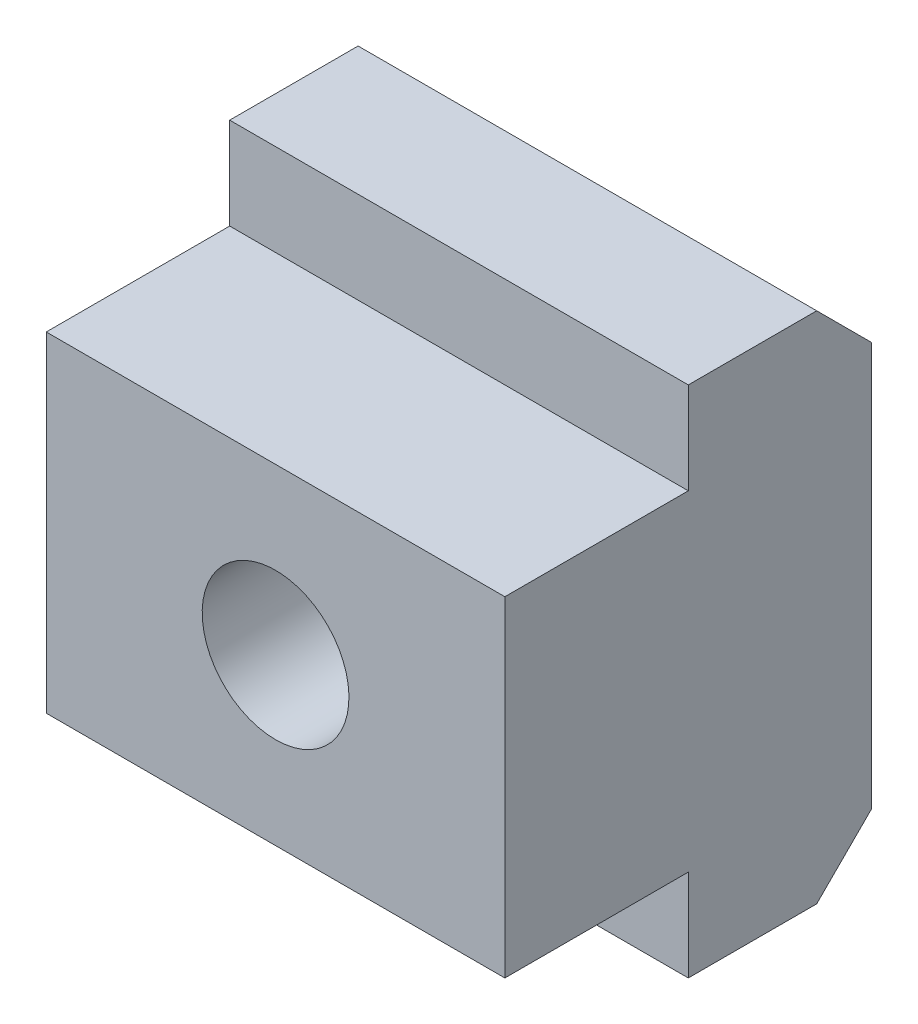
ISO-10303-21;
HEADER;
FILE_DESCRIPTION(('STEP AP214'),'2;1');
FILE_NAME('part.step','',(''),(''),'','','');
FILE_SCHEMA(('AUTOMOTIVE_DESIGN { 1 0 10303 214 1 1 1 1 }'));
ENDSEC;
DATA;
#1=APPLICATION_CONTEXT('core data for automotive mechanical design processes');
#2=APPLICATION_PROTOCOL_DEFINITION('international standard','automotive_design',2000,#1);
#3=PRODUCT_CONTEXT('',#1,'mechanical');
#4=PRODUCT('Part','Part','',(#3));
#5=PRODUCT_RELATED_PRODUCT_CATEGORY('part','',(#4));
#6=PRODUCT_DEFINITION_FORMATION('','',#4);
#7=PRODUCT_DEFINITION_CONTEXT('part definition',#1,'design');
#8=PRODUCT_DEFINITION('design','',#6,#7);
#9=PRODUCT_DEFINITION_SHAPE('','',#8);
#10=(LENGTH_UNIT() NAMED_UNIT(*) SI_UNIT(.MILLI.,.METRE.));
#11=(NAMED_UNIT(*) PLANE_ANGLE_UNIT() SI_UNIT($,.RADIAN.));
#12=(NAMED_UNIT(*) SI_UNIT($,.STERADIAN.) SOLID_ANGLE_UNIT());
#13=UNCERTAINTY_MEASURE_WITH_UNIT(LENGTH_MEASURE(1.E-05),#10,'distance_accuracy_value','');
#14=(GEOMETRIC_REPRESENTATION_CONTEXT(3) GLOBAL_UNCERTAINTY_ASSIGNED_CONTEXT((#13)) GLOBAL_UNIT_ASSIGNED_CONTEXT((#10,
#11,#12)) REPRESENTATION_CONTEXT('',''));
#15=CARTESIAN_POINT('',(0.,0.,0.));
#16=DIRECTION('',(0.,0.,1.));
#17=DIRECTION('',(1.,0.,0.));
#18=AXIS2_PLACEMENT_3D('',#15,#16,#17);
#19=CARTESIAN_POINT('',(12.5,9.,10.));
#20=DIRECTION('',(0.,-1.,0.));
#21=DIRECTION('',(0.,0.,-1.));
#22=AXIS2_PLACEMENT_3D('',#19,#20,#21);
#23=PLANE('',#22);
#24=DIRECTION('',(0.,0.,1.));
#25=VECTOR('',#24,1.);
#26=CARTESIAN_POINT('',(-12.5,9.,10.));
#27=LINE('',#26,#25);
#28=CARTESIAN_POINT('',(-12.5,9.,0.));
#29=VERTEX_POINT('',#28);
#30=CARTESIAN_POINT('',(-12.5,9.,10.));
#31=VERTEX_POINT('',#30);
#32=EDGE_CURVE('E98',#29,#31,#27,.T.);
#33=ORIENTED_EDGE('',*,*,#32,.T.);
#34=DIRECTION('',(-1.,0.,0.));
#35=VECTOR('',#34,1.);
#36=CARTESIAN_POINT('',(12.5,9.,10.));
#37=LINE('',#36,#35);
#38=CARTESIAN_POINT('',(12.5,9.,10.));
#39=VERTEX_POINT('',#38);
#40=EDGE_CURVE('E106',#39,#31,#37,.T.);
#41=ORIENTED_EDGE('',*,*,#40,.F.);
#42=DIRECTION('',(0.,0.,1.));
#43=VECTOR('',#42,1.);
#44=CARTESIAN_POINT('',(12.5,9.,10.));
#45=LINE('',#44,#43);
#46=CARTESIAN_POINT('',(12.5,9.,0.));
#47=VERTEX_POINT('',#46);
#48=EDGE_CURVE('E136',#47,#39,#45,.T.);
#49=ORIENTED_EDGE('',*,*,#48,.F.);
#50=DIRECTION('',(-1.,0.,0.));
#51=VECTOR('',#50,1.);
#52=CARTESIAN_POINT('',(12.5,9.,0.));
#53=LINE('',#52,#51);
#54=EDGE_CURVE('E117',#47,#29,#53,.T.);
#55=ORIENTED_EDGE('',*,*,#54,.T.);
#56=EDGE_LOOP('',(#33,#41,#49,#55));
#57=FACE_BOUND('',#56,.T.);
#58=ADVANCED_FACE('F14',(#57),#23,.F.);
#59=CARTESIAN_POINT('',(12.5,-9.,10.));
#60=DIRECTION('',(0.,0.,-1.));
#61=DIRECTION('',(0.,1.,0.));
#62=AXIS2_PLACEMENT_3D('',#59,#60,#61);
#63=PLANE('',#62);
#64=CARTESIAN_POINT('',(0.,0.,10.));
#65=DIRECTION('',(0.,0.,1.));
#66=DIRECTION('',(0.,-1.,0.));
#67=AXIS2_PLACEMENT_3D('',#64,#65,#66);
#68=CIRCLE('',#67,4.);
#69=CARTESIAN_POINT('',(0.,-4.,10.));
#70=VERTEX_POINT('',#69);
#71=EDGE_CURVE('E121',#70,#70,#68,.T.);
#72=ORIENTED_EDGE('',*,*,#71,.F.);
#73=EDGE_LOOP('',(#72));
#74=FACE_BOUND('',#73,.T.);
#75=DIRECTION('',(0.,-1.,0.));
#76=VECTOR('',#75,1.);
#77=CARTESIAN_POINT('',(-12.5,-9.,10.));
#78=LINE('',#77,#76);
#79=CARTESIAN_POINT('',(-12.5,-9.,10.));
#80=VERTEX_POINT('',#79);
#81=EDGE_CURVE('E92',#31,#80,#78,.T.);
#82=ORIENTED_EDGE('',*,*,#81,.T.);
#83=DIRECTION('',(-1.,0.,0.));
#84=VECTOR('',#83,1.);
#85=CARTESIAN_POINT('',(12.5,-9.,10.));
#86=LINE('',#85,#84);
#87=CARTESIAN_POINT('',(12.5,-9.,10.));
#88=VERTEX_POINT('',#87);
#89=EDGE_CURVE('E113',#88,#80,#86,.T.);
#90=ORIENTED_EDGE('',*,*,#89,.F.);
#91=DIRECTION('',(0.,-1.,0.));
#92=VECTOR('',#91,1.);
#93=CARTESIAN_POINT('',(12.5,-9.,10.));
#94=LINE('',#93,#92);
#95=EDGE_CURVE('E108',#39,#88,#94,.T.);
#96=ORIENTED_EDGE('',*,*,#95,.F.);
#97=ORIENTED_EDGE('',*,*,#40,.T.);
#98=EDGE_LOOP('',(#82,#90,#96,#97));
#99=FACE_BOUND('',#98,.T.);
#100=ADVANCED_FACE('F107',(#74,#99),#63,.F.);
#101=CARTESIAN_POINT('',(12.5,-9.,10.));
#102=DIRECTION('',(0.,1.,0.));
#103=DIRECTION('',(-1.,0.,0.));
#104=AXIS2_PLACEMENT_3D('',#101,#102,#103);
#105=PLANE('',#104);
#106=DIRECTION('',(0.,0.,-1.));
#107=VECTOR('',#106,1.);
#108=CARTESIAN_POINT('',(-12.5,-9.,10.));
#109=LINE('',#108,#107);
#110=CARTESIAN_POINT('',(-12.5,-9.,0.));
#111=VERTEX_POINT('',#110);
#112=EDGE_CURVE('E100',#80,#111,#109,.T.);
#113=ORIENTED_EDGE('',*,*,#112,.T.);
#114=DIRECTION('',(-1.,0.,0.));
#115=VECTOR('',#114,1.);
#116=CARTESIAN_POINT('',(12.5,-9.,0.));
#117=LINE('',#116,#115);
#118=CARTESIAN_POINT('',(12.5,-9.,0.));
#119=VERTEX_POINT('',#118);
#120=EDGE_CURVE('E158',#119,#111,#117,.T.);
#121=ORIENTED_EDGE('',*,*,#120,.F.);
#122=DIRECTION('',(0.,0.,-1.));
#123=VECTOR('',#122,1.);
#124=CARTESIAN_POINT('',(12.5,-9.,10.));
#125=LINE('',#124,#123);
#126=EDGE_CURVE('E139',#88,#119,#125,.T.);
#127=ORIENTED_EDGE('',*,*,#126,.F.);
#128=ORIENTED_EDGE('',*,*,#89,.T.);
#129=EDGE_LOOP('',(#113,#121,#127,#128));
#130=FACE_BOUND('',#129,.T.);
#131=ADVANCED_FACE('F199',(#130),#105,.F.);
#132=CARTESIAN_POINT('',(12.5,-9.,0.));
#133=DIRECTION('',(0.,0.,-1.));
#134=DIRECTION('',(0.,1.,0.));
#135=AXIS2_PLACEMENT_3D('',#132,#133,#134);
#136=PLANE('',#135);
#137=DIRECTION('',(0.,-1.,0.));
#138=VECTOR('',#137,1.);
#139=CARTESIAN_POINT('',(-12.5,-9.,0.));
#140=LINE('',#139,#138);
#141=CARTESIAN_POINT('',(-12.5,-14.,0.));
#142=VERTEX_POINT('',#141);
#143=EDGE_CURVE('E126',#111,#142,#140,.T.);
#144=ORIENTED_EDGE('',*,*,#143,.T.);
#145=DIRECTION('',(-1.,0.,0.));
#146=VECTOR('',#145,1.);
#147=CARTESIAN_POINT('',(12.5,-14.,0.));
#148=LINE('',#147,#146);
#149=CARTESIAN_POINT('',(12.5,-14.,0.));
#150=VERTEX_POINT('',#149);
#151=EDGE_CURVE('E155',#150,#142,#148,.T.);
#152=ORIENTED_EDGE('',*,*,#151,.F.);
#153=DIRECTION('',(0.,-1.,0.));
#154=VECTOR('',#153,1.);
#155=CARTESIAN_POINT('',(12.5,-9.,0.));
#156=LINE('',#155,#154);
#157=EDGE_CURVE('E141',#119,#150,#156,.T.);
#158=ORIENTED_EDGE('',*,*,#157,.F.);
#159=ORIENTED_EDGE('',*,*,#120,.T.);
#160=EDGE_LOOP('',(#144,#152,#158,#159));
#161=FACE_BOUND('',#160,.T.);
#162=ADVANCED_FACE('F195',(#161),#136,.F.);
#163=CARTESIAN_POINT('',(12.5,-14.,0.));
#164=DIRECTION('',(0.,1.,0.));
#165=DIRECTION('',(0.,0.,1.));
#166=AXIS2_PLACEMENT_3D('',#163,#164,#165);
#167=PLANE('',#166);
#168=DIRECTION('',(0.,0.,-1.));
#169=VECTOR('',#168,1.);
#170=CARTESIAN_POINT('',(-12.5,-14.,0.));
#171=LINE('',#170,#169);
#172=CARTESIAN_POINT('',(-12.5,-14.,-7.));
#173=VERTEX_POINT('',#172);
#174=EDGE_CURVE('E128',#142,#173,#171,.T.);
#175=ORIENTED_EDGE('',*,*,#174,.T.);
#176=DIRECTION('',(1.,0.,0.));
#177=VECTOR('',#176,1.);
#178=CARTESIAN_POINT('',(12.5,-14.,-7.));
#179=LINE('',#178,#177);
#180=CARTESIAN_POINT('',(12.5,-14.,-7.));
#181=VERTEX_POINT('',#180);
#182=EDGE_CURVE('E9',#173,#181,#179,.T.);
#183=ORIENTED_EDGE('',*,*,#182,.T.);
#184=DIRECTION('',(0.,0.,-1.));
#185=VECTOR('',#184,1.);
#186=CARTESIAN_POINT('',(12.5,-14.,0.));
#187=LINE('',#186,#185);
#188=EDGE_CURVE('E143',#150,#181,#187,.T.);
#189=ORIENTED_EDGE('',*,*,#188,.F.);
#190=ORIENTED_EDGE('',*,*,#151,.T.);
#191=EDGE_LOOP('',(#175,#183,#189,#190));
#192=FACE_BOUND('',#191,.T.);
#193=ADVANCED_FACE('F191',(#192),#167,.F.);
#194=CARTESIAN_POINT('',(12.5,-14.,-10.));
#195=DIRECTION('',(0.,0.,1.));
#196=DIRECTION('',(0.,-1.,0.));
#197=AXIS2_PLACEMENT_3D('',#194,#195,#196);
#198=PLANE('',#197);
#199=CARTESIAN_POINT('',(0.,0.,-10.));
#200=DIRECTION('',(0.,0.,1.));
#201=DIRECTION('',(0.,-1.,0.));
#202=AXIS2_PLACEMENT_3D('',#199,#200,#201);
#203=CIRCLE('',#202,4.);
#204=CARTESIAN_POINT('',(0.,-3.99999999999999,-10.));
#205=VERTEX_POINT('',#204);
#206=EDGE_CURVE('E118',#205,#205,#203,.T.);
#207=ORIENTED_EDGE('',*,*,#206,.T.);
#208=EDGE_LOOP('',(#207));
#209=FACE_BOUND('',#208,.T.);
#210=DIRECTION('',(0.,1.,0.));
#211=VECTOR('',#210,1.);
#212=CARTESIAN_POINT('',(-12.5,-14.,-10.));
#213=LINE('',#212,#211);
#214=CARTESIAN_POINT('',(-12.5,-11.,-10.));
#215=VERTEX_POINT('',#214);
#216=CARTESIAN_POINT('',(-12.5,11.,-10.));
#217=VERTEX_POINT('',#216);
#218=EDGE_CURVE('E130',#215,#217,#213,.T.);
#219=ORIENTED_EDGE('',*,*,#218,.T.);
#220=DIRECTION('',(1.,0.,0.));
#221=VECTOR('',#220,1.);
#222=CARTESIAN_POINT('',(12.5,11.,-10.));
#223=LINE('',#222,#221);
#224=CARTESIAN_POINT('',(12.5,11.,-10.));
#225=VERTEX_POINT('',#224);
#226=EDGE_CURVE('E34',#217,#225,#223,.T.);
#227=ORIENTED_EDGE('',*,*,#226,.T.);
#228=DIRECTION('',(0.,1.,0.));
#229=VECTOR('',#228,1.);
#230=CARTESIAN_POINT('',(12.5,-14.,-10.));
#231=LINE('',#230,#229);
#232=CARTESIAN_POINT('',(12.5,-11.,-10.));
#233=VERTEX_POINT('',#232);
#234=EDGE_CURVE('E145',#233,#225,#231,.T.);
#235=ORIENTED_EDGE('',*,*,#234,.F.);
#236=DIRECTION('',(-1.,0.,0.));
#237=VECTOR('',#236,1.);
#238=CARTESIAN_POINT('',(12.5,-11.,-10.));
#239=LINE('',#238,#237);
#240=EDGE_CURVE('E168',#233,#215,#239,.T.);
#241=ORIENTED_EDGE('',*,*,#240,.T.);
#242=EDGE_LOOP('',(#219,#227,#235,#241));
#243=FACE_BOUND('',#242,.T.);
#244=ADVANCED_FACE('F185',(#209,#243),#198,.F.);
#245=CARTESIAN_POINT('',(12.5,14.,0.));
#246=DIRECTION('',(0.,-1.,0.));
#247=DIRECTION('',(0.,0.,-1.));
#248=AXIS2_PLACEMENT_3D('',#245,#246,#247);
#249=PLANE('',#248);
#250=DIRECTION('',(0.,0.,1.));
#251=VECTOR('',#250,1.);
#252=CARTESIAN_POINT('',(12.5,14.,0.));
#253=LINE('',#252,#251);
#254=CARTESIAN_POINT('',(12.5,14.,-7.));
#255=VERTEX_POINT('',#254);
#256=CARTESIAN_POINT('',(12.5,14.,0.));
#257=VERTEX_POINT('',#256);
#258=EDGE_CURVE('E147',#255,#257,#253,.T.);
#259=ORIENTED_EDGE('',*,*,#258,.F.);
#260=DIRECTION('',(-1.,0.,0.));
#261=VECTOR('',#260,1.);
#262=CARTESIAN_POINT('',(12.5,14.,-7.));
#263=LINE('',#262,#261);
#264=CARTESIAN_POINT('',(-12.5,14.,-7.));
#265=VERTEX_POINT('',#264);
#266=EDGE_CURVE('E112',#255,#265,#263,.T.);
#267=ORIENTED_EDGE('',*,*,#266,.T.);
#268=DIRECTION('',(0.,0.,1.));
#269=VECTOR('',#268,1.);
#270=CARTESIAN_POINT('',(-12.5,14.,0.));
#271=LINE('',#270,#269);
#272=CARTESIAN_POINT('',(-12.5,14.,0.));
#273=VERTEX_POINT('',#272);
#274=EDGE_CURVE('E132',#265,#273,#271,.T.);
#275=ORIENTED_EDGE('',*,*,#274,.T.);
#276=DIRECTION('',(-1.,0.,0.));
#277=VECTOR('',#276,1.);
#278=CARTESIAN_POINT('',(12.5,14.,0.));
#279=LINE('',#278,#277);
#280=EDGE_CURVE('E152',#257,#273,#279,.T.);
#281=ORIENTED_EDGE('',*,*,#280,.F.);
#282=EDGE_LOOP('',(#259,#267,#275,#281));
#283=FACE_BOUND('',#282,.T.);
#284=ADVANCED_FACE('F181',(#283),#249,.F.);
#285=CARTESIAN_POINT('',(12.5,9.,0.));
#286=DIRECTION('',(0.,0.,-1.));
#287=DIRECTION('',(0.,1.,0.));
#288=AXIS2_PLACEMENT_3D('',#285,#286,#287);
#289=PLANE('',#288);
#290=DIRECTION('',(0.,-1.,0.));
#291=VECTOR('',#290,1.);
#292=CARTESIAN_POINT('',(-12.5,9.,0.));
#293=LINE('',#292,#291);
#294=EDGE_CURVE('E134',#273,#29,#293,.T.);
#295=ORIENTED_EDGE('',*,*,#294,.T.);
#296=ORIENTED_EDGE('',*,*,#54,.F.);
#297=DIRECTION('',(0.,-1.,0.));
#298=VECTOR('',#297,1.);
#299=CARTESIAN_POINT('',(12.5,9.,0.));
#300=LINE('',#299,#298);
#301=EDGE_CURVE('E149',#257,#47,#300,.T.);
#302=ORIENTED_EDGE('',*,*,#301,.F.);
#303=ORIENTED_EDGE('',*,*,#280,.T.);
#304=EDGE_LOOP('',(#295,#296,#302,#303));
#305=FACE_BOUND('',#304,.T.);
#306=ADVANCED_FACE('F201',(#305),#289,.F.);
#307=CARTESIAN_POINT('',(12.5,9.,10.));
#308=DIRECTION('',(1.,0.,0.));
#309=DIRECTION('',(0.,1.,0.));
#310=AXIS2_PLACEMENT_3D('',#307,#308,#309);
#311=PLANE('',#310);
#312=ORIENTED_EDGE('',*,*,#234,.T.);
#313=DIRECTION('',(0.,-0.707106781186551,-0.707106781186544));
#314=VECTOR('',#313,1.);
#315=CARTESIAN_POINT('',(12.5,20.,-1.));
#316=LINE('',#315,#314);
#317=EDGE_CURVE('E21',#225,#255,#316,.F.);
#318=ORIENTED_EDGE('',*,*,#317,.T.);
#319=ORIENTED_EDGE('',*,*,#258,.T.);
#320=ORIENTED_EDGE('',*,*,#301,.T.);
#321=ORIENTED_EDGE('',*,*,#48,.T.);
#322=ORIENTED_EDGE('',*,*,#95,.T.);
#323=ORIENTED_EDGE('',*,*,#126,.T.);
#324=ORIENTED_EDGE('',*,*,#157,.T.);
#325=ORIENTED_EDGE('',*,*,#188,.T.);
#326=DIRECTION('',(0.,-0.707106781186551,0.707106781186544));
#327=VECTOR('',#326,1.);
#328=CARTESIAN_POINT('',(12.5,-10.9999999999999,-10.));
#329=LINE('',#328,#327);
#330=EDGE_CURVE('E172',#181,#233,#329,.F.);
#331=ORIENTED_EDGE('',*,*,#330,.T.);
#332=EDGE_LOOP('',(#312,#318,#319,#320,#321,#322,#323,#324,#325,#331));
#333=FACE_BOUND('',#332,.T.);
#334=ADVANCED_FACE('F176',(#333),#311,.T.);
#335=CARTESIAN_POINT('',(-12.5,9.,10.));
#336=DIRECTION('',(1.,0.,0.));
#337=DIRECTION('',(0.,1.,0.));
#338=AXIS2_PLACEMENT_3D('',#335,#336,#337);
#339=PLANE('',#338);
#340=ORIENTED_EDGE('',*,*,#274,.F.);
#341=DIRECTION('',(0.,0.707106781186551,0.707106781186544));
#342=VECTOR('',#341,1.);
#343=CARTESIAN_POINT('',(-12.5,14.,-7.));
#344=LINE('',#343,#342);
#345=EDGE_CURVE('E166',#265,#217,#344,.F.);
#346=ORIENTED_EDGE('',*,*,#345,.T.);
#347=ORIENTED_EDGE('',*,*,#218,.F.);
#348=DIRECTION('',(0.,0.707106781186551,-0.707106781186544));
#349=VECTOR('',#348,1.);
#350=CARTESIAN_POINT('',(-12.5,-11.,-10.));
#351=LINE('',#350,#349);
#352=EDGE_CURVE('E164',#215,#173,#351,.F.);
#353=ORIENTED_EDGE('',*,*,#352,.T.);
#354=ORIENTED_EDGE('',*,*,#174,.F.);
#355=ORIENTED_EDGE('',*,*,#143,.F.);
#356=ORIENTED_EDGE('',*,*,#112,.F.);
#357=ORIENTED_EDGE('',*,*,#81,.F.);
#358=ORIENTED_EDGE('',*,*,#32,.F.);
#359=ORIENTED_EDGE('',*,*,#294,.F.);
#360=EDGE_LOOP('',(#340,#346,#347,#353,#354,#355,#356,#357,#358,#359));
#361=FACE_BOUND('',#360,.T.);
#362=ADVANCED_FACE('F95',(#361),#339,.F.);
#363=CARTESIAN_POINT('',(12.5,14.,-7.));
#364=DIRECTION('',(0.,-0.707106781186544,0.707106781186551));
#365=DIRECTION('',(0.,-0.707106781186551,-0.707106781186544));
#366=AXIS2_PLACEMENT_3D('',#363,#364,#365);
#367=PLANE('',#366);
#368=ORIENTED_EDGE('',*,*,#317,.F.);
#369=ORIENTED_EDGE('',*,*,#226,.F.);
#370=ORIENTED_EDGE('',*,*,#345,.F.);
#371=ORIENTED_EDGE('',*,*,#266,.F.);
#372=EDGE_LOOP('',(#368,#369,#370,#371));
#373=FACE_BOUND('',#372,.T.);
#374=ADVANCED_FACE('F183',(#373),#367,.F.);
#375=CARTESIAN_POINT('',(12.5,-11.,-10.));
#376=DIRECTION('',(0.,0.707106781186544,0.707106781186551));
#377=DIRECTION('',(0.,-0.707106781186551,0.707106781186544));
#378=AXIS2_PLACEMENT_3D('',#375,#376,#377);
#379=PLANE('',#378);
#380=ORIENTED_EDGE('',*,*,#330,.F.);
#381=ORIENTED_EDGE('',*,*,#182,.F.);
#382=ORIENTED_EDGE('',*,*,#352,.F.);
#383=ORIENTED_EDGE('',*,*,#240,.F.);
#384=EDGE_LOOP('',(#380,#381,#382,#383));
#385=FACE_BOUND('',#384,.T.);
#386=ADVANCED_FACE('F189',(#385),#379,.F.);
#387=CARTESIAN_POINT('',(0.,0.,-10.));
#388=DIRECTION('',(0.,0.,1.));
#389=DIRECTION('',(0.,-1.,0.));
#390=AXIS2_PLACEMENT_3D('',#387,#388,#389);
#391=CYLINDRICAL_SURFACE('',#390,4.);
#392=ORIENTED_EDGE('',*,*,#206,.F.);
#393=EDGE_LOOP('',(#392));
#394=FACE_BOUND('',#393,.T.);
#395=ORIENTED_EDGE('',*,*,#71,.T.);
#396=EDGE_LOOP('',(#395));
#397=FACE_BOUND('',#396,.T.);
#398=ADVANCED_FACE('F236',(#394,#397),#391,.F.);
#399=CLOSED_SHELL('',(#58,#100,#131,#162,#193,#244,#284,#306,#334,#362,#374,#386,#398));
#400=MANIFOLD_SOLID_BREP('B1',#399);
#401=ADVANCED_BREP_SHAPE_REPRESENTATION('',(#18,#400),#14);
#402=SHAPE_DEFINITION_REPRESENTATION(#9,#401);
ENDSEC;
END-ISO-10303-21;
